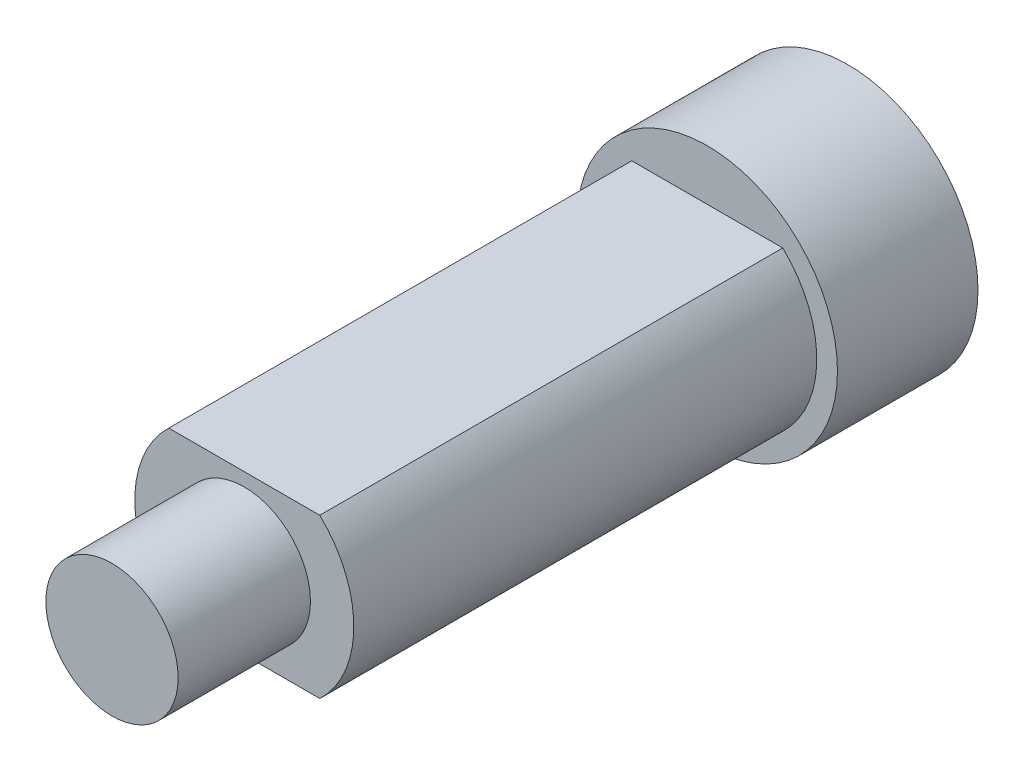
ISO-10303-21;
HEADER;
FILE_DESCRIPTION(('STEP AP214'),'2;1');
FILE_NAME('part.step','',(''),(''),'','','');
FILE_SCHEMA(('AUTOMOTIVE_DESIGN { 1 0 10303 214 1 1 1 1 }'));
ENDSEC;
DATA;
#1=APPLICATION_CONTEXT('core data for automotive mechanical design processes');
#2=APPLICATION_PROTOCOL_DEFINITION('international standard','automotive_design',2000,#1);
#3=PRODUCT_CONTEXT('',#1,'mechanical');
#4=PRODUCT('Part','Part','',(#3));
#5=PRODUCT_RELATED_PRODUCT_CATEGORY('part','',(#4));
#6=PRODUCT_DEFINITION_FORMATION('','',#4);
#7=PRODUCT_DEFINITION_CONTEXT('part definition',#1,'design');
#8=PRODUCT_DEFINITION('design','',#6,#7);
#9=PRODUCT_DEFINITION_SHAPE('','',#8);
#10=(LENGTH_UNIT() NAMED_UNIT(*) SI_UNIT(.MILLI.,.METRE.));
#11=(NAMED_UNIT(*) PLANE_ANGLE_UNIT() SI_UNIT($,.RADIAN.));
#12=(NAMED_UNIT(*) SI_UNIT($,.STERADIAN.) SOLID_ANGLE_UNIT());
#13=UNCERTAINTY_MEASURE_WITH_UNIT(LENGTH_MEASURE(1.E-05),#10,'distance_accuracy_value','');
#14=(GEOMETRIC_REPRESENTATION_CONTEXT(3) GLOBAL_UNCERTAINTY_ASSIGNED_CONTEXT((#13)) GLOBAL_UNIT_ASSIGNED_CONTEXT((#10,
#11,#12)) REPRESENTATION_CONTEXT('',''));
#15=CARTESIAN_POINT('',(0.,0.,0.));
#16=DIRECTION('',(0.,0.,1.));
#17=DIRECTION('',(1.,0.,0.));
#18=AXIS2_PLACEMENT_3D('',#15,#16,#17);
#19=CARTESIAN_POINT('',(0.,0.,57.94248));
#20=DIRECTION('',(0.,0.,1.));
#21=DIRECTION('',(1.,0.,0.));
#22=AXIS2_PLACEMENT_3D('',#19,#20,#21);
#23=PLANE('',#22);
#24=CARTESIAN_POINT('',(0.,0.,57.94248));
#25=DIRECTION('',(0.,0.,1.));
#26=DIRECTION('',(1.,0.,0.));
#27=AXIS2_PLACEMENT_3D('',#24,#25,#26);
#28=CIRCLE('',#27,10.51687);
#29=CARTESIAN_POINT('',(7.24845877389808,-7.62,57.94248));
#30=VERTEX_POINT('',#29);
#31=CARTESIAN_POINT('',(7.24845877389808,7.62,57.94248));
#32=VERTEX_POINT('',#31);
#33=EDGE_CURVE('E80',#30,#32,#28,.T.);
#34=ORIENTED_EDGE('',*,*,#33,.T.);
#35=DIRECTION('',(-1.,0.,0.));
#36=VECTOR('',#35,1.);
#37=CARTESIAN_POINT('',(-7.24845877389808,7.62,57.94248));
#38=LINE('',#37,#36);
#39=CARTESIAN_POINT('',(-7.24845877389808,7.62,57.94248));
#40=VERTEX_POINT('',#39);
#41=EDGE_CURVE('E75',#32,#40,#38,.T.);
#42=ORIENTED_EDGE('',*,*,#41,.T.);
#43=CARTESIAN_POINT('',(0.,0.,57.94248));
#44=DIRECTION('',(0.,0.,1.));
#45=DIRECTION('',(1.,0.,0.));
#46=AXIS2_PLACEMENT_3D('',#43,#44,#45);
#47=CIRCLE('',#46,10.51687);
#48=CARTESIAN_POINT('',(-7.24845877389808,-7.62,57.94248));
#49=VERTEX_POINT('',#48);
#50=EDGE_CURVE('E78',#40,#49,#47,.T.);
#51=ORIENTED_EDGE('',*,*,#50,.T.);
#52=DIRECTION('',(1.,0.,0.));
#53=VECTOR('',#52,1.);
#54=CARTESIAN_POINT('',(-7.24845877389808,-7.62,57.94248));
#55=LINE('',#54,#53);
#56=EDGE_CURVE('E54',#49,#30,#55,.T.);
#57=ORIENTED_EDGE('',*,*,#56,.T.);
#58=EDGE_LOOP('',(#34,#42,#51,#57));
#59=FACE_BOUND('',#58,.T.);
#60=CARTESIAN_POINT('',(0.,0.,57.94248));
#61=DIRECTION('',(0.,0.,1.));
#62=DIRECTION('',(1.,0.,0.));
#63=AXIS2_PLACEMENT_3D('',#60,#61,#62);
#64=CIRCLE('',#63,6.35);
#65=CARTESIAN_POINT('',(6.35,0.,57.94248));
#66=VERTEX_POINT('',#65);
#67=EDGE_CURVE('E203',#66,#66,#64,.T.);
#68=ORIENTED_EDGE('',*,*,#67,.F.);
#69=EDGE_LOOP('',(#68));
#70=FACE_BOUND('',#69,.T.);
#71=ADVANCED_FACE('F31',(#59,#70),#23,.T.);
#72=CARTESIAN_POINT('',(0.,0.,13.49248));
#73=DIRECTION('',(0.,0.,1.));
#74=DIRECTION('',(1.,0.,0.));
#75=AXIS2_PLACEMENT_3D('',#72,#73,#74);
#76=PLANE('',#75);
#77=CARTESIAN_POINT('',(0.,0.,13.49248));
#78=DIRECTION('',(0.,0.,1.));
#79=DIRECTION('',(1.,0.,0.));
#80=AXIS2_PLACEMENT_3D('',#77,#78,#79);
#81=CIRCLE('',#80,12.50061);
#82=CARTESIAN_POINT('',(12.50061,0.,13.49248));
#83=VERTEX_POINT('',#82);
#84=EDGE_CURVE('E11',#83,#83,#81,.T.);
#85=ORIENTED_EDGE('',*,*,#84,.T.);
#86=EDGE_LOOP('',(#85));
#87=FACE_BOUND('',#86,.T.);
#88=DIRECTION('',(-1.,0.,0.));
#89=VECTOR('',#88,1.);
#90=CARTESIAN_POINT('',(-7.24845877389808,7.62,13.49248));
#91=LINE('',#90,#89);
#92=CARTESIAN_POINT('',(7.24845877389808,7.62,13.49248));
#93=VERTEX_POINT('',#92);
#94=CARTESIAN_POINT('',(-7.24845877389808,7.62,13.49248));
#95=VERTEX_POINT('',#94);
#96=EDGE_CURVE('E87',#93,#95,#91,.T.);
#97=ORIENTED_EDGE('',*,*,#96,.F.);
#98=CARTESIAN_POINT('',(0.,0.,13.49248));
#99=DIRECTION('',(0.,0.,1.));
#100=DIRECTION('',(1.,0.,0.));
#101=AXIS2_PLACEMENT_3D('',#98,#99,#100);
#102=CIRCLE('',#101,10.51687);
#103=CARTESIAN_POINT('',(7.24845877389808,-7.62,13.49248));
#104=VERTEX_POINT('',#103);
#105=EDGE_CURVE('E98',#104,#93,#102,.T.);
#106=ORIENTED_EDGE('',*,*,#105,.F.);
#107=DIRECTION('',(1.,0.,0.));
#108=VECTOR('',#107,1.);
#109=CARTESIAN_POINT('',(-7.24845877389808,-7.62,13.49248));
#110=LINE('',#109,#108);
#111=CARTESIAN_POINT('',(-7.24845877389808,-7.62,13.49248));
#112=VERTEX_POINT('',#111);
#113=EDGE_CURVE('E68',#112,#104,#110,.T.);
#114=ORIENTED_EDGE('',*,*,#113,.F.);
#115=CARTESIAN_POINT('',(0.,0.,13.49248));
#116=DIRECTION('',(0.,0.,1.));
#117=DIRECTION('',(1.,0.,0.));
#118=AXIS2_PLACEMENT_3D('',#115,#116,#117);
#119=CIRCLE('',#118,10.51687);
#120=EDGE_CURVE('E103',#95,#112,#119,.T.);
#121=ORIENTED_EDGE('',*,*,#120,.F.);
#122=EDGE_LOOP('',(#97,#106,#114,#121));
#123=FACE_BOUND('',#122,.T.);
#124=ADVANCED_FACE('F121',(#87,#123),#76,.T.);
#125=CARTESIAN_POINT('',(0.,0.,13.49248));
#126=DIRECTION('',(0.,0.,-1.));
#127=DIRECTION('',(-1.,0.,0.));
#128=AXIS2_PLACEMENT_3D('',#125,#126,#127);
#129=CYLINDRICAL_SURFACE('',#128,12.50061);
#130=ORIENTED_EDGE('',*,*,#84,.F.);
#131=EDGE_LOOP('',(#130));
#132=FACE_BOUND('',#131,.T.);
#133=CARTESIAN_POINT('',(0.,0.,0.));
#134=DIRECTION('',(0.,0.,1.));
#135=DIRECTION('',(1.,0.,0.));
#136=AXIS2_PLACEMENT_3D('',#133,#134,#135);
#137=CIRCLE('',#136,12.50061);
#138=CARTESIAN_POINT('',(12.50061,0.,0.));
#139=VERTEX_POINT('',#138);
#140=EDGE_CURVE('E35',#139,#139,#137,.T.);
#141=ORIENTED_EDGE('',*,*,#140,.T.);
#142=EDGE_LOOP('',(#141));
#143=FACE_BOUND('',#142,.T.);
#144=ADVANCED_FACE('F33',(#132,#143),#129,.T.);
#145=CARTESIAN_POINT('',(0.,0.,0.));
#146=DIRECTION('',(0.,0.,1.));
#147=DIRECTION('',(1.,0.,0.));
#148=AXIS2_PLACEMENT_3D('',#145,#146,#147);
#149=PLANE('',#148);
#150=ORIENTED_EDGE('',*,*,#140,.F.);
#151=EDGE_LOOP('',(#150));
#152=FACE_BOUND('',#151,.T.);
#153=ADVANCED_FACE('F112',(#152),#149,.F.);
#154=CARTESIAN_POINT('',(0.,0.,57.94248));
#155=DIRECTION('',(0.,0.,-1.));
#156=DIRECTION('',(-1.,0.,0.));
#157=AXIS2_PLACEMENT_3D('',#154,#155,#156);
#158=CYLINDRICAL_SURFACE('',#157,10.51687);
#159=ORIENTED_EDGE('',*,*,#105,.T.);
#160=DIRECTION('',(0.,0.,-1.));
#161=VECTOR('',#160,1.);
#162=CARTESIAN_POINT('',(7.24845877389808,7.62,57.94248));
#163=LINE('',#162,#161);
#164=EDGE_CURVE('E90',#32,#93,#163,.T.);
#165=ORIENTED_EDGE('',*,*,#164,.F.);
#166=ORIENTED_EDGE('',*,*,#33,.F.);
#167=DIRECTION('',(0.,0.,-1.));
#168=VECTOR('',#167,1.);
#169=CARTESIAN_POINT('',(7.24845877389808,-7.62,57.94248));
#170=LINE('',#169,#168);
#171=EDGE_CURVE('E94',#30,#104,#170,.T.);
#172=ORIENTED_EDGE('',*,*,#171,.T.);
#173=EDGE_LOOP('',(#159,#165,#166,#172));
#174=FACE_BOUND('',#173,.T.);
#175=ADVANCED_FACE('F114',(#174),#158,.T.);
#176=CARTESIAN_POINT('',(-7.24845877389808,7.62,57.94248));
#177=DIRECTION('',(0.,-1.,0.));
#178=DIRECTION('',(0.,0.,-1.));
#179=AXIS2_PLACEMENT_3D('',#176,#177,#178);
#180=PLANE('',#179);
#181=ORIENTED_EDGE('',*,*,#96,.T.);
#182=DIRECTION('',(0.,0.,-1.));
#183=VECTOR('',#182,1.);
#184=CARTESIAN_POINT('',(-7.24845877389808,7.62,57.94248));
#185=LINE('',#184,#183);
#186=EDGE_CURVE('E84',#40,#95,#185,.T.);
#187=ORIENTED_EDGE('',*,*,#186,.F.);
#188=ORIENTED_EDGE('',*,*,#41,.F.);
#189=ORIENTED_EDGE('',*,*,#164,.T.);
#190=EDGE_LOOP('',(#181,#187,#188,#189));
#191=FACE_BOUND('',#190,.T.);
#192=ADVANCED_FACE('F85',(#191),#180,.F.);
#193=CARTESIAN_POINT('',(0.,0.,57.94248));
#194=DIRECTION('',(0.,0.,-1.));
#195=DIRECTION('',(-1.,0.,0.));
#196=AXIS2_PLACEMENT_3D('',#193,#194,#195);
#197=CYLINDRICAL_SURFACE('',#196,10.51687);
#198=ORIENTED_EDGE('',*,*,#120,.T.);
#199=DIRECTION('',(0.,0.,-1.));
#200=VECTOR('',#199,1.);
#201=CARTESIAN_POINT('',(-7.24845877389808,-7.62,57.94248));
#202=LINE('',#201,#200);
#203=EDGE_CURVE('E46',#49,#112,#202,.T.);
#204=ORIENTED_EDGE('',*,*,#203,.F.);
#205=ORIENTED_EDGE('',*,*,#50,.F.);
#206=ORIENTED_EDGE('',*,*,#186,.T.);
#207=EDGE_LOOP('',(#198,#204,#205,#206));
#208=FACE_BOUND('',#207,.T.);
#209=ADVANCED_FACE('F92',(#208),#197,.T.);
#210=CARTESIAN_POINT('',(-7.24845877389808,-7.62,57.94248));
#211=DIRECTION('',(0.,1.,0.));
#212=DIRECTION('',(0.,0.,1.));
#213=AXIS2_PLACEMENT_3D('',#210,#211,#212);
#214=PLANE('',#213);
#215=ORIENTED_EDGE('',*,*,#113,.T.);
#216=ORIENTED_EDGE('',*,*,#171,.F.);
#217=ORIENTED_EDGE('',*,*,#56,.F.);
#218=ORIENTED_EDGE('',*,*,#203,.T.);
#219=EDGE_LOOP('',(#215,#216,#217,#218));
#220=FACE_BOUND('',#219,.T.);
#221=ADVANCED_FACE('F134',(#220),#214,.F.);
#222=CARTESIAN_POINT('',(0.,0.,70.64248));
#223=DIRECTION('',(0.,0.,-1.));
#224=DIRECTION('',(-1.,0.,0.));
#225=AXIS2_PLACEMENT_3D('',#222,#223,#224);
#226=CYLINDRICAL_SURFACE('',#225,6.35);
#227=CARTESIAN_POINT('',(0.,0.,70.64248));
#228=DIRECTION('',(0.,0.,1.));
#229=DIRECTION('',(1.,0.,0.));
#230=AXIS2_PLACEMENT_3D('',#227,#228,#229);
#231=CIRCLE('',#230,6.35);
#232=CARTESIAN_POINT('',(6.35,0.,70.64248));
#233=VERTEX_POINT('',#232);
#234=EDGE_CURVE('E101',#233,#233,#231,.T.);
#235=ORIENTED_EDGE('',*,*,#234,.F.);
#236=EDGE_LOOP('',(#235));
#237=FACE_BOUND('',#236,.T.);
#238=ORIENTED_EDGE('',*,*,#67,.T.);
#239=EDGE_LOOP('',(#238));
#240=FACE_BOUND('',#239,.T.);
#241=ADVANCED_FACE('F132',(#237,#240),#226,.T.);
#242=CARTESIAN_POINT('',(0.,0.,70.64248));
#243=DIRECTION('',(0.,0.,1.));
#244=DIRECTION('',(1.,0.,0.));
#245=AXIS2_PLACEMENT_3D('',#242,#243,#244);
#246=PLANE('',#245);
#247=ORIENTED_EDGE('',*,*,#234,.T.);
#248=EDGE_LOOP('',(#247));
#249=FACE_BOUND('',#248,.T.);
#250=ADVANCED_FACE('F158',(#249),#246,.T.);
#251=CLOSED_SHELL('',(#71,#124,#144,#153,#175,#192,#209,#221,#241,#250));
#252=MANIFOLD_SOLID_BREP('B2',#251);
#253=ADVANCED_BREP_SHAPE_REPRESENTATION('',(#18,#252),#14);
#254=SHAPE_DEFINITION_REPRESENTATION(#9,#253);
ENDSEC;
END-ISO-10303-21;
